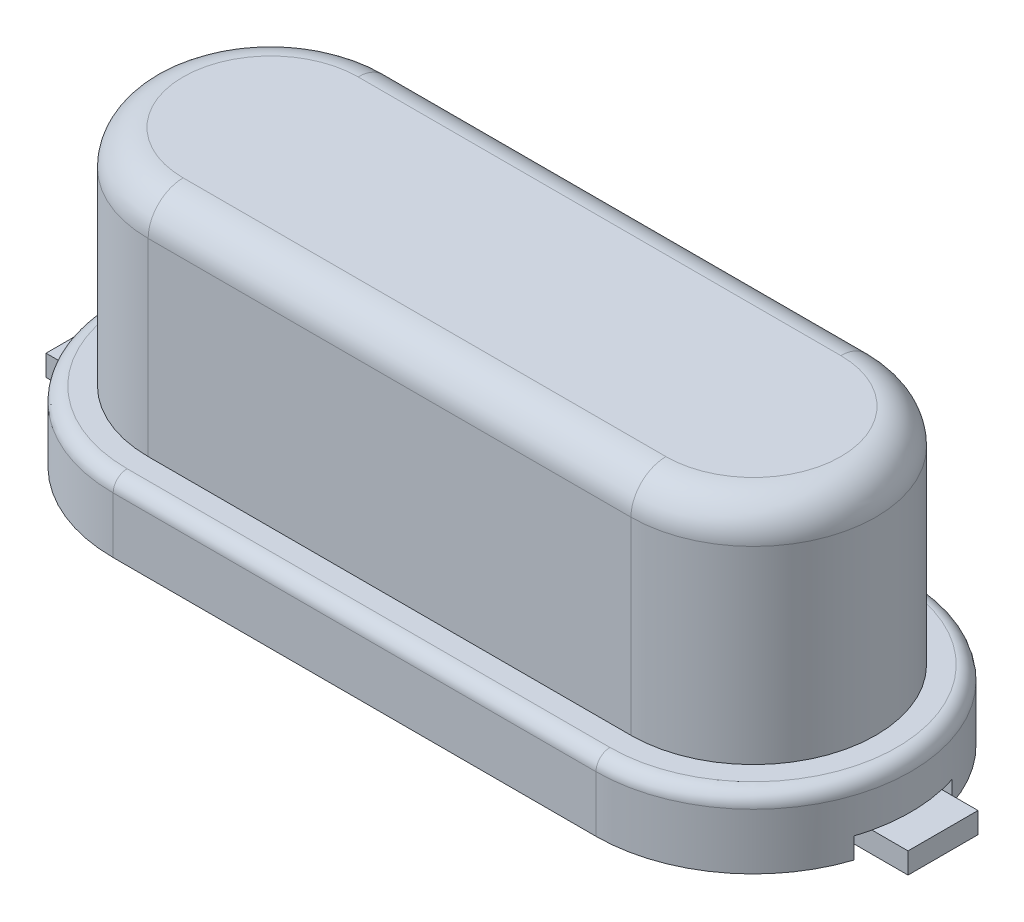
ISO-10303-21;
HEADER;
FILE_DESCRIPTION(('STEP AP214'),'2;1');
FILE_NAME('part.step','',(''),(''),'','','');
FILE_SCHEMA(('AUTOMOTIVE_DESIGN { 1 0 10303 214 1 1 1 1 }'));
ENDSEC;
DATA;
#1=APPLICATION_CONTEXT('core data for automotive mechanical design processes');
#2=APPLICATION_PROTOCOL_DEFINITION('international standard','automotive_design',2000,#1);
#3=PRODUCT_CONTEXT('',#1,'mechanical');
#4=PRODUCT('Part','Part','',(#3));
#5=PRODUCT_RELATED_PRODUCT_CATEGORY('part','',(#4));
#6=PRODUCT_DEFINITION_FORMATION('','',#4);
#7=PRODUCT_DEFINITION_CONTEXT('part definition',#1,'design');
#8=PRODUCT_DEFINITION('design','',#6,#7);
#9=PRODUCT_DEFINITION_SHAPE('','',#8);
#10=(LENGTH_UNIT() NAMED_UNIT(*) SI_UNIT(.MILLI.,.METRE.));
#11=(NAMED_UNIT(*) PLANE_ANGLE_UNIT() SI_UNIT($,.RADIAN.));
#12=(NAMED_UNIT(*) SI_UNIT($,.STERADIAN.) SOLID_ANGLE_UNIT());
#13=UNCERTAINTY_MEASURE_WITH_UNIT(LENGTH_MEASURE(1.E-05),#10,'distance_accuracy_value','');
#14=(GEOMETRIC_REPRESENTATION_CONTEXT(3) GLOBAL_UNCERTAINTY_ASSIGNED_CONTEXT((#13)) GLOBAL_UNIT_ASSIGNED_CONTEXT((#10,
#11,#12)) REPRESENTATION_CONTEXT('',''));
#15=CARTESIAN_POINT('',(0.,0.,0.));
#16=DIRECTION('',(0.,0.,1.));
#17=DIRECTION('',(1.,0.,0.));
#18=AXIS2_PLACEMENT_3D('',#15,#16,#17);
#19=CARTESIAN_POINT('',(3.45,1.,0.));
#20=DIRECTION('',(0.,1.,0.));
#21=DIRECTION('',(0.,0.,1.));
#22=AXIS2_PLACEMENT_3D('',#19,#20,#21);
#23=PLANE('',#22);
#24=DIRECTION('',(-1.,0.,0.));
#25=VECTOR('',#24,1.);
#26=CARTESIAN_POINT('',(-3.45,1.,-2.05));
#27=LINE('',#26,#25);
#28=CARTESIAN_POINT('',(3.45,1.,-2.05));
#29=VERTEX_POINT('',#28);
#30=CARTESIAN_POINT('',(-3.45,1.,-2.05));
#31=VERTEX_POINT('',#30);
#32=EDGE_CURVE('E487',#29,#31,#27,.T.);
#33=ORIENTED_EDGE('',*,*,#32,.T.);
#34=CARTESIAN_POINT('',(-3.45,1.,0.));
#35=DIRECTION('',(0.,1.,0.));
#36=DIRECTION('',(0.,0.,1.));
#37=AXIS2_PLACEMENT_3D('',#34,#35,#36);
#38=CIRCLE('',#37,2.05);
#39=CARTESIAN_POINT('',(-3.45,1.,2.05));
#40=VERTEX_POINT('',#39);
#41=EDGE_CURVE('E490',#31,#40,#38,.T.);
#42=ORIENTED_EDGE('',*,*,#41,.T.);
#43=DIRECTION('',(1.,0.,0.));
#44=VECTOR('',#43,1.);
#45=CARTESIAN_POINT('',(3.45,1.,2.05));
#46=LINE('',#45,#44);
#47=CARTESIAN_POINT('',(3.45,1.,2.05));
#48=VERTEX_POINT('',#47);
#49=EDGE_CURVE('E481',#40,#48,#46,.T.);
#50=ORIENTED_EDGE('',*,*,#49,.T.);
#51=CARTESIAN_POINT('',(3.45,1.,0.));
#52=DIRECTION('',(0.,1.,0.));
#53=DIRECTION('',(0.,0.,1.));
#54=AXIS2_PLACEMENT_3D('',#51,#52,#53);
#55=CIRCLE('',#54,2.05);
#56=EDGE_CURVE('E484',#48,#29,#55,.T.);
#57=ORIENTED_EDGE('',*,*,#56,.T.);
#58=EDGE_LOOP('',(#33,#42,#50,#57));
#59=FACE_BOUND('',#58,.T.);
#60=DIRECTION('',(-1.,0.,0.));
#61=VECTOR('',#60,1.);
#62=CARTESIAN_POINT('',(3.45,1.,-1.75));
#63=LINE('',#62,#61);
#64=CARTESIAN_POINT('',(3.45,1.,-1.75));
#65=VERTEX_POINT('',#64);
#66=CARTESIAN_POINT('',(-3.45,1.,-1.75));
#67=VERTEX_POINT('',#66);
#68=EDGE_CURVE('E257',#65,#67,#63,.T.);
#69=ORIENTED_EDGE('',*,*,#68,.F.);
#70=CARTESIAN_POINT('',(3.45,1.,0.));
#71=DIRECTION('',(0.,1.,0.));
#72=DIRECTION('',(0.,0.,1.));
#73=AXIS2_PLACEMENT_3D('',#70,#71,#72);
#74=CIRCLE('',#73,1.75);
#75=CARTESIAN_POINT('',(3.45,1.,1.75));
#76=VERTEX_POINT('',#75);
#77=EDGE_CURVE('E238',#76,#65,#74,.T.);
#78=ORIENTED_EDGE('',*,*,#77,.F.);
#79=DIRECTION('',(1.,0.,0.));
#80=VECTOR('',#79,1.);
#81=CARTESIAN_POINT('',(-3.45,1.,1.75));
#82=LINE('',#81,#80);
#83=CARTESIAN_POINT('',(-3.45,1.,1.75));
#84=VERTEX_POINT('',#83);
#85=EDGE_CURVE('E246',#84,#76,#82,.T.);
#86=ORIENTED_EDGE('',*,*,#85,.F.);
#87=CARTESIAN_POINT('',(-3.45,1.,0.));
#88=DIRECTION('',(0.,1.,0.));
#89=DIRECTION('',(0.,0.,1.));
#90=AXIS2_PLACEMENT_3D('',#87,#88,#89);
#91=CIRCLE('',#90,1.75);
#92=EDGE_CURVE('E270',#67,#84,#91,.T.);
#93=ORIENTED_EDGE('',*,*,#92,.F.);
#94=EDGE_LOOP('',(#69,#78,#86,#93));
#95=FACE_BOUND('',#94,.T.);
#96=ADVANCED_FACE('F37',(#59,#95),#23,.T.);
#97=CARTESIAN_POINT('',(3.45,0.3,0.));
#98=DIRECTION('',(0.,1.,0.));
#99=DIRECTION('',(0.,0.,1.));
#100=AXIS2_PLACEMENT_3D('',#97,#98,#99);
#101=PLANE('',#100);
#102=DIRECTION('',(1.,0.,0.));
#103=VECTOR('',#102,1.);
#104=CARTESIAN_POINT('',(-1.64,0.3,-0.699999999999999));
#105=LINE('',#104,#103);
#106=CARTESIAN_POINT('',(-5.58834047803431,0.3,-0.699999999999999));
#107=VERTEX_POINT('',#106);
#108=CARTESIAN_POINT('',(-1.64,0.3,-0.699999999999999));
#109=VERTEX_POINT('',#108);
#110=EDGE_CURVE('E277',#107,#109,#105,.T.);
#111=ORIENTED_EDGE('',*,*,#110,.T.);
#112=DIRECTION('',(0.,0.,1.));
#113=VECTOR('',#112,1.);
#114=CARTESIAN_POINT('',(-1.64,0.3,0.7));
#115=LINE('',#114,#113);
#116=CARTESIAN_POINT('',(-1.64,0.3,0.7));
#117=VERTEX_POINT('',#116);
#118=EDGE_CURVE('E282',#109,#117,#115,.T.);
#119=ORIENTED_EDGE('',*,*,#118,.T.);
#120=DIRECTION('',(-1.,0.,0.));
#121=VECTOR('',#120,1.);
#122=CARTESIAN_POINT('',(-5.58834047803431,0.3,0.7));
#123=LINE('',#122,#121);
#124=CARTESIAN_POINT('',(-5.58834047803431,0.3,0.700000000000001));
#125=VERTEX_POINT('',#124);
#126=EDGE_CURVE('E286',#117,#125,#123,.T.);
#127=ORIENTED_EDGE('',*,*,#126,.T.);
#128=CARTESIAN_POINT('',(-3.45,0.3,0.));
#129=DIRECTION('',(0.,1.,0.));
#130=DIRECTION('',(0.,0.,1.));
#131=AXIS2_PLACEMENT_3D('',#128,#129,#130);
#132=CIRCLE('',#131,2.25);
#133=CARTESIAN_POINT('',(-5.64374109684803,0.3,0.5));
#134=VERTEX_POINT('',#133);
#135=EDGE_CURVE('E418',#134,#125,#132,.T.);
#136=ORIENTED_EDGE('',*,*,#135,.F.);
#137=DIRECTION('',(1.,0.,0.));
#138=VECTOR('',#137,1.);
#139=CARTESIAN_POINT('',(-6.16,0.3,0.5));
#140=LINE('',#139,#138);
#141=CARTESIAN_POINT('',(-1.84,0.3,0.5));
#142=VERTEX_POINT('',#141);
#143=EDGE_CURVE('E440',#134,#142,#140,.T.);
#144=ORIENTED_EDGE('',*,*,#143,.T.);
#145=DIRECTION('',(0.,0.,-1.));
#146=VECTOR('',#145,1.);
#147=CARTESIAN_POINT('',(-1.84,0.3,0.5));
#148=LINE('',#147,#146);
#149=CARTESIAN_POINT('',(-1.84,0.3,-0.5));
#150=VERTEX_POINT('',#149);
#151=EDGE_CURVE('E445',#142,#150,#148,.T.);
#152=ORIENTED_EDGE('',*,*,#151,.T.);
#153=DIRECTION('',(-1.,0.,0.));
#154=VECTOR('',#153,1.);
#155=CARTESIAN_POINT('',(-6.16,0.3,-0.5));
#156=LINE('',#155,#154);
#157=CARTESIAN_POINT('',(-5.64374109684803,0.3,-0.5));
#158=VERTEX_POINT('',#157);
#159=EDGE_CURVE('E450',#150,#158,#156,.T.);
#160=ORIENTED_EDGE('',*,*,#159,.T.);
#161=EDGE_CURVE('E420',#107,#158,#132,.T.);
#162=ORIENTED_EDGE('',*,*,#161,.F.);
#163=EDGE_LOOP('',(#111,#119,#127,#136,#144,#152,#160,#162));
#164=FACE_BOUND('',#163,.T.);
#165=ADVANCED_FACE('F585',(#164),#101,.F.);
#166=DIRECTION('',(1.,0.,0.));
#167=VECTOR('',#166,1.);
#168=CARTESIAN_POINT('',(5.58834047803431,0.3,-0.700000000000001));
#169=LINE('',#168,#167);
#170=CARTESIAN_POINT('',(1.64,0.3,-0.7));
#171=VERTEX_POINT('',#170);
#172=CARTESIAN_POINT('',(5.58834047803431,0.3,-0.700000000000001));
#173=VERTEX_POINT('',#172);
#174=EDGE_CURVE('E273',#171,#173,#169,.T.);
#175=ORIENTED_EDGE('',*,*,#174,.T.);
#176=CARTESIAN_POINT('',(3.45,0.3,0.));
#177=DIRECTION('',(0.,1.,0.));
#178=DIRECTION('',(0.,0.,1.));
#179=AXIS2_PLACEMENT_3D('',#176,#177,#178);
#180=CIRCLE('',#179,2.25);
#181=CARTESIAN_POINT('',(5.64374109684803,0.3,-0.5));
#182=VERTEX_POINT('',#181);
#183=EDGE_CURVE('E414',#182,#173,#180,.T.);
#184=ORIENTED_EDGE('',*,*,#183,.F.);
#185=DIRECTION('',(-1.,0.,0.));
#186=VECTOR('',#185,1.);
#187=CARTESIAN_POINT('',(6.16,0.3,-0.5));
#188=LINE('',#187,#186);
#189=CARTESIAN_POINT('',(1.84,0.3,-0.5));
#190=VERTEX_POINT('',#189);
#191=EDGE_CURVE('E378',#182,#190,#188,.T.);
#192=ORIENTED_EDGE('',*,*,#191,.T.);
#193=DIRECTION('',(0.,0.,1.));
#194=VECTOR('',#193,1.);
#195=CARTESIAN_POINT('',(1.84,0.3,0.5));
#196=LINE('',#195,#194);
#197=CARTESIAN_POINT('',(1.84,0.3,0.5));
#198=VERTEX_POINT('',#197);
#199=EDGE_CURVE('E382',#190,#198,#196,.T.);
#200=ORIENTED_EDGE('',*,*,#199,.T.);
#201=DIRECTION('',(1.,0.,0.));
#202=VECTOR('',#201,1.);
#203=CARTESIAN_POINT('',(6.16,0.3,0.5));
#204=LINE('',#203,#202);
#205=CARTESIAN_POINT('',(5.64374109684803,0.3,0.5));
#206=VERTEX_POINT('',#205);
#207=EDGE_CURVE('E370',#198,#206,#204,.T.);
#208=ORIENTED_EDGE('',*,*,#207,.T.);
#209=CARTESIAN_POINT('',(5.58834047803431,0.3,0.7));
#210=VERTEX_POINT('',#209);
#211=EDGE_CURVE('E415',#210,#206,#180,.T.);
#212=ORIENTED_EDGE('',*,*,#211,.F.);
#213=DIRECTION('',(-1.,0.,0.));
#214=VECTOR('',#213,1.);
#215=CARTESIAN_POINT('',(1.64,0.3,0.7));
#216=LINE('',#215,#214);
#217=CARTESIAN_POINT('',(1.64,0.3,0.7));
#218=VERTEX_POINT('',#217);
#219=EDGE_CURVE('E290',#210,#218,#216,.T.);
#220=ORIENTED_EDGE('',*,*,#219,.T.);
#221=DIRECTION('',(0.,0.,-1.));
#222=VECTOR('',#221,1.);
#223=CARTESIAN_POINT('',(1.64,0.3,-0.7));
#224=LINE('',#223,#222);
#225=EDGE_CURVE('E294',#218,#171,#224,.T.);
#226=ORIENTED_EDGE('',*,*,#225,.T.);
#227=EDGE_LOOP('',(#175,#184,#192,#200,#208,#212,#220,#226));
#228=FACE_BOUND('',#227,.T.);
#229=ADVANCED_FACE('F591',(#228),#101,.F.);
#230=CARTESIAN_POINT('',(-6.16,0.3,-0.5));
#231=DIRECTION('',(0.,-1.,0.));
#232=DIRECTION('',(0.,0.,-1.));
#233=AXIS2_PLACEMENT_3D('',#230,#231,#232);
#234=PLANE('',#233);
#235=EDGE_CURVE('E424',#158,#134,#132,.T.);
#236=ORIENTED_EDGE('',*,*,#235,.F.);
#237=CARTESIAN_POINT('',(-6.16,0.3,-0.5));
#238=VERTEX_POINT('',#237);
#239=EDGE_CURVE('E449',#158,#238,#156,.T.);
#240=ORIENTED_EDGE('',*,*,#239,.T.);
#241=DIRECTION('',(0.,0.,1.));
#242=VECTOR('',#241,1.);
#243=CARTESIAN_POINT('',(-6.16,0.3,0.5));
#244=LINE('',#243,#242);
#245=CARTESIAN_POINT('',(-6.16,0.3,0.5));
#246=VERTEX_POINT('',#245);
#247=EDGE_CURVE('E437',#238,#246,#244,.T.);
#248=ORIENTED_EDGE('',*,*,#247,.T.);
#249=EDGE_CURVE('E442',#246,#134,#140,.T.);
#250=ORIENTED_EDGE('',*,*,#249,.T.);
#251=EDGE_LOOP('',(#236,#240,#248,#250));
#252=FACE_BOUND('',#251,.T.);
#253=ADVANCED_FACE('F616',(#252),#234,.F.);
#254=CARTESIAN_POINT('',(-6.16,0.3,0.5));
#255=DIRECTION('',(1.,0.,0.));
#256=DIRECTION('',(0.,0.,-1.));
#257=AXIS2_PLACEMENT_3D('',#254,#255,#256);
#258=PLANE('',#257);
#259=DIRECTION('',(0.,0.,1.));
#260=VECTOR('',#259,1.);
#261=CARTESIAN_POINT('',(-6.16,0.,0.5));
#262=LINE('',#261,#260);
#263=CARTESIAN_POINT('',(-6.16,0.,-0.5));
#264=VERTEX_POINT('',#263);
#265=CARTESIAN_POINT('',(-6.16,0.,0.5));
#266=VERTEX_POINT('',#265);
#267=EDGE_CURVE('E436',#264,#266,#262,.T.);
#268=ORIENTED_EDGE('',*,*,#267,.T.);
#269=DIRECTION('',(0.,-1.,0.));
#270=VECTOR('',#269,1.);
#271=CARTESIAN_POINT('',(-6.16,0.3,0.5));
#272=LINE('',#271,#270);
#273=EDGE_CURVE('E477',#246,#266,#272,.T.);
#274=ORIENTED_EDGE('',*,*,#273,.F.);
#275=ORIENTED_EDGE('',*,*,#247,.F.);
#276=DIRECTION('',(0.,-1.,0.));
#277=VECTOR('',#276,1.);
#278=CARTESIAN_POINT('',(-6.16,0.3,-0.5));
#279=LINE('',#278,#277);
#280=EDGE_CURVE('E454',#238,#264,#279,.T.);
#281=ORIENTED_EDGE('',*,*,#280,.T.);
#282=EDGE_LOOP('',(#268,#274,#275,#281));
#283=FACE_BOUND('',#282,.T.);
#284=ADVANCED_FACE('F619',(#283),#258,.F.);
#285=CARTESIAN_POINT('',(-6.16,0.3,0.5));
#286=DIRECTION('',(0.,0.,-1.));
#287=DIRECTION('',(-1.,0.,0.));
#288=AXIS2_PLACEMENT_3D('',#285,#286,#287);
#289=PLANE('',#288);
#290=DIRECTION('',(1.,0.,0.));
#291=VECTOR('',#290,1.);
#292=CARTESIAN_POINT('',(-6.16,0.,0.5));
#293=LINE('',#292,#291);
#294=CARTESIAN_POINT('',(-1.84,0.,0.5));
#295=VERTEX_POINT('',#294);
#296=EDGE_CURVE('E458',#266,#295,#293,.T.);
#297=ORIENTED_EDGE('',*,*,#296,.T.);
#298=DIRECTION('',(0.,-1.,0.));
#299=VECTOR('',#298,1.);
#300=CARTESIAN_POINT('',(-1.84,0.3,0.5));
#301=LINE('',#300,#299);
#302=EDGE_CURVE('E473',#142,#295,#301,.T.);
#303=ORIENTED_EDGE('',*,*,#302,.F.);
#304=ORIENTED_EDGE('',*,*,#143,.F.);
#305=ORIENTED_EDGE('',*,*,#249,.F.);
#306=ORIENTED_EDGE('',*,*,#273,.T.);
#307=EDGE_LOOP('',(#297,#303,#304,#305,#306));
#308=FACE_BOUND('',#307,.T.);
#309=ADVANCED_FACE('F631',(#308),#289,.F.);
#310=CARTESIAN_POINT('',(-1.84,0.3,0.5));
#311=DIRECTION('',(-1.,0.,0.));
#312=DIRECTION('',(0.,0.,1.));
#313=AXIS2_PLACEMENT_3D('',#310,#311,#312);
#314=PLANE('',#313);
#315=DIRECTION('',(0.,0.,-1.));
#316=VECTOR('',#315,1.);
#317=CARTESIAN_POINT('',(-1.84,0.,0.5));
#318=LINE('',#317,#316);
#319=CARTESIAN_POINT('',(-1.84,0.,-0.5));
#320=VERTEX_POINT('',#319);
#321=EDGE_CURVE('E461',#295,#320,#318,.T.);
#322=ORIENTED_EDGE('',*,*,#321,.T.);
#323=DIRECTION('',(0.,-1.,0.));
#324=VECTOR('',#323,1.);
#325=CARTESIAN_POINT('',(-1.84,0.3,-0.5));
#326=LINE('',#325,#324);
#327=EDGE_CURVE('E469',#150,#320,#326,.T.);
#328=ORIENTED_EDGE('',*,*,#327,.F.);
#329=ORIENTED_EDGE('',*,*,#151,.F.);
#330=ORIENTED_EDGE('',*,*,#302,.T.);
#331=EDGE_LOOP('',(#322,#328,#329,#330));
#332=FACE_BOUND('',#331,.T.);
#333=ADVANCED_FACE('F627',(#332),#314,.F.);
#334=CARTESIAN_POINT('',(-6.16,0.3,-0.5));
#335=DIRECTION('',(0.,0.,1.));
#336=DIRECTION('',(1.,0.,0.));
#337=AXIS2_PLACEMENT_3D('',#334,#335,#336);
#338=PLANE('',#337);
#339=DIRECTION('',(-1.,0.,0.));
#340=VECTOR('',#339,1.);
#341=CARTESIAN_POINT('',(-6.16,0.,-0.5));
#342=LINE('',#341,#340);
#343=EDGE_CURVE('E441',#320,#264,#342,.T.);
#344=ORIENTED_EDGE('',*,*,#343,.T.);
#345=ORIENTED_EDGE('',*,*,#280,.F.);
#346=ORIENTED_EDGE('',*,*,#239,.F.);
#347=ORIENTED_EDGE('',*,*,#159,.F.);
#348=ORIENTED_EDGE('',*,*,#327,.T.);
#349=EDGE_LOOP('',(#344,#345,#346,#347,#348));
#350=FACE_BOUND('',#349,.T.);
#351=ADVANCED_FACE('F623',(#350),#338,.F.);
#352=CARTESIAN_POINT('',(-6.16,0.,-0.5));
#353=DIRECTION('',(0.,-1.,0.));
#354=DIRECTION('',(0.,0.,-1.));
#355=AXIS2_PLACEMENT_3D('',#352,#353,#354);
#356=PLANE('',#355);
#357=ORIENTED_EDGE('',*,*,#267,.F.);
#358=ORIENTED_EDGE('',*,*,#343,.F.);
#359=ORIENTED_EDGE('',*,*,#321,.F.);
#360=ORIENTED_EDGE('',*,*,#296,.F.);
#361=EDGE_LOOP('',(#357,#358,#359,#360));
#362=FACE_BOUND('',#361,.T.);
#363=ADVANCED_FACE('F614',(#362),#356,.T.);
#364=CARTESIAN_POINT('',(3.45,1.,0.));
#365=DIRECTION('',(0.,-1.,0.));
#366=DIRECTION('',(0.,0.,-1.));
#367=AXIS2_PLACEMENT_3D('',#364,#365,#366);
#368=CYLINDRICAL_SURFACE('',#367,2.25);
#369=DIRECTION('',(0.,-1.,0.));
#370=VECTOR('',#369,1.);
#371=CARTESIAN_POINT('',(3.45,1.,-2.25));
#372=LINE('',#371,#370);
#373=CARTESIAN_POINT('',(3.45,0.8,-2.25));
#374=VERTEX_POINT('',#373);
#375=CARTESIAN_POINT('',(3.45,0.,-2.25));
#376=VERTEX_POINT('',#375);
#377=EDGE_CURVE('E433',#374,#376,#372,.T.);
#378=ORIENTED_EDGE('',*,*,#377,.F.);
#379=CARTESIAN_POINT('',(3.45,0.8,0.));
#380=DIRECTION('',(0.,1.,0.));
#381=DIRECTION('',(0.,0.,1.));
#382=AXIS2_PLACEMENT_3D('',#379,#380,#381);
#383=CIRCLE('',#382,2.25);
#384=CARTESIAN_POINT('',(3.45,0.8,2.25));
#385=VERTEX_POINT('',#384);
#386=EDGE_CURVE('E501',#374,#385,#383,.F.);
#387=ORIENTED_EDGE('',*,*,#386,.T.);
#388=DIRECTION('',(0.,-1.,0.));
#389=VECTOR('',#388,1.);
#390=CARTESIAN_POINT('',(3.45,1.,2.25));
#391=LINE('',#390,#389);
#392=CARTESIAN_POINT('',(3.45,0.,2.25));
#393=VERTEX_POINT('',#392);
#394=EDGE_CURVE('E423',#385,#393,#391,.T.);
#395=ORIENTED_EDGE('',*,*,#394,.T.);
#396=CARTESIAN_POINT('',(3.45,0.,0.));
#397=DIRECTION('',(0.,1.,0.));
#398=DIRECTION('',(0.,0.,1.));
#399=AXIS2_PLACEMENT_3D('',#396,#397,#398);
#400=CIRCLE('',#399,2.25);
#401=CARTESIAN_POINT('',(5.58834047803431,0.,0.7));
#402=VERTEX_POINT('',#401);
#403=EDGE_CURVE('E330',#393,#402,#400,.T.);
#404=ORIENTED_EDGE('',*,*,#403,.T.);
#405=DIRECTION('',(0.,-1.,0.));
#406=VECTOR('',#405,1.);
#407=CARTESIAN_POINT('',(5.58834047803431,0.3,0.7));
#408=LINE('',#407,#406);
#409=EDGE_CURVE('E345',#210,#402,#408,.T.);
#410=ORIENTED_EDGE('',*,*,#409,.F.);
#411=ORIENTED_EDGE('',*,*,#211,.T.);
#412=EDGE_CURVE('E419',#206,#182,#180,.T.);
#413=ORIENTED_EDGE('',*,*,#412,.T.);
#414=ORIENTED_EDGE('',*,*,#183,.T.);
#415=DIRECTION('',(0.,-1.,0.));
#416=VECTOR('',#415,1.);
#417=CARTESIAN_POINT('',(5.58834047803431,0.3,-0.700000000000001));
#418=LINE('',#417,#416);
#419=CARTESIAN_POINT('',(5.58834047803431,0.,-0.700000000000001));
#420=VERTEX_POINT('',#419);
#421=EDGE_CURVE('E365',#173,#420,#418,.T.);
#422=ORIENTED_EDGE('',*,*,#421,.T.);
#423=CARTESIAN_POINT('',(3.45,0.,0.));
#424=DIRECTION('',(0.,1.,0.));
#425=DIRECTION('',(0.,0.,1.));
#426=AXIS2_PLACEMENT_3D('',#423,#424,#425);
#427=CIRCLE('',#426,2.25);
#428=EDGE_CURVE('E302',#420,#376,#427,.T.);
#429=ORIENTED_EDGE('',*,*,#428,.T.);
#430=EDGE_LOOP('',(#378,#387,#395,#404,#410,#411,#413,#414,#422,#429));
#431=FACE_BOUND('',#430,.T.);
#432=ADVANCED_FACE('F610',(#431),#368,.T.);
#433=CARTESIAN_POINT('',(3.45,1.,-2.25));
#434=DIRECTION('',(0.,0.,1.));
#435=DIRECTION('',(1.,0.,0.));
#436=AXIS2_PLACEMENT_3D('',#433,#434,#435);
#437=PLANE('',#436);
#438=DIRECTION('',(0.,-1.,0.));
#439=VECTOR('',#438,1.);
#440=CARTESIAN_POINT('',(-3.45,1.,-2.25));
#441=LINE('',#440,#439);
#442=CARTESIAN_POINT('',(-3.45,0.8,-2.25));
#443=VERTEX_POINT('',#442);
#444=CARTESIAN_POINT('',(-3.45,0.,-2.25));
#445=VERTEX_POINT('',#444);
#446=EDGE_CURVE('E430',#443,#445,#441,.T.);
#447=ORIENTED_EDGE('',*,*,#446,.F.);
#448=DIRECTION('',(-1.,0.,0.));
#449=VECTOR('',#448,1.);
#450=CARTESIAN_POINT('',(3.45,0.8,-2.25));
#451=LINE('',#450,#449);
#452=EDGE_CURVE('E498',#443,#374,#451,.F.);
#453=ORIENTED_EDGE('',*,*,#452,.T.);
#454=ORIENTED_EDGE('',*,*,#377,.T.);
#455=DIRECTION('',(-1.,0.,0.));
#456=VECTOR('',#455,1.);
#457=CARTESIAN_POINT('',(-3.45,0.,-2.25));
#458=LINE('',#457,#456);
#459=EDGE_CURVE('E306',#376,#445,#458,.T.);
#460=ORIENTED_EDGE('',*,*,#459,.T.);
#461=EDGE_LOOP('',(#447,#453,#454,#460));
#462=FACE_BOUND('',#461,.T.);
#463=ADVANCED_FACE('F606',(#462),#437,.F.);
#464=CARTESIAN_POINT('',(-3.45,1.,0.));
#465=DIRECTION('',(0.,-1.,0.));
#466=DIRECTION('',(0.,0.,-1.));
#467=AXIS2_PLACEMENT_3D('',#464,#465,#466);
#468=CYLINDRICAL_SURFACE('',#467,2.25);
#469=DIRECTION('',(0.,-1.,0.));
#470=VECTOR('',#469,1.);
#471=CARTESIAN_POINT('',(-3.45,1.,2.25));
#472=LINE('',#471,#470);
#473=CARTESIAN_POINT('',(-3.45,0.8,2.25));
#474=VERTEX_POINT('',#473);
#475=CARTESIAN_POINT('',(-3.45,0.,2.25));
#476=VERTEX_POINT('',#475);
#477=EDGE_CURVE('E427',#474,#476,#472,.T.);
#478=ORIENTED_EDGE('',*,*,#477,.F.);
#479=CARTESIAN_POINT('',(-3.45,0.8,0.));
#480=DIRECTION('',(0.,1.,0.));
#481=DIRECTION('',(0.,0.,1.));
#482=AXIS2_PLACEMENT_3D('',#479,#480,#481);
#483=CIRCLE('',#482,2.25);
#484=EDGE_CURVE('E494',#474,#443,#483,.F.);
#485=ORIENTED_EDGE('',*,*,#484,.T.);
#486=ORIENTED_EDGE('',*,*,#446,.T.);
#487=CARTESIAN_POINT('',(-3.45,0.,0.));
#488=DIRECTION('',(0.,1.,0.));
#489=DIRECTION('',(0.,0.,-1.));
#490=AXIS2_PLACEMENT_3D('',#487,#488,#489);
#491=CIRCLE('',#490,2.25);
#492=CARTESIAN_POINT('',(-5.58834047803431,0.,-0.699999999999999));
#493=VERTEX_POINT('',#492);
#494=EDGE_CURVE('E310',#445,#493,#491,.T.);
#495=ORIENTED_EDGE('',*,*,#494,.T.);
#496=DIRECTION('',(0.,-1.,0.));
#497=VECTOR('',#496,1.);
#498=CARTESIAN_POINT('',(-5.58834047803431,0.3,-0.699999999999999));
#499=LINE('',#498,#497);
#500=EDGE_CURVE('E361',#107,#493,#499,.T.);
#501=ORIENTED_EDGE('',*,*,#500,.F.);
#502=ORIENTED_EDGE('',*,*,#161,.T.);
#503=ORIENTED_EDGE('',*,*,#235,.T.);
#504=ORIENTED_EDGE('',*,*,#135,.T.);
#505=DIRECTION('',(0.,-1.,0.));
#506=VECTOR('',#505,1.);
#507=CARTESIAN_POINT('',(-5.58834047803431,0.3,0.700000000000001));
#508=LINE('',#507,#506);
#509=CARTESIAN_POINT('',(-5.58834047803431,0.,0.700000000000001));
#510=VERTEX_POINT('',#509);
#511=EDGE_CURVE('E349',#125,#510,#508,.T.);
#512=ORIENTED_EDGE('',*,*,#511,.T.);
#513=CARTESIAN_POINT('',(-3.45,0.,0.));
#514=DIRECTION('',(0.,1.,0.));
#515=DIRECTION('',(0.,0.,-1.));
#516=AXIS2_PLACEMENT_3D('',#513,#514,#515);
#517=CIRCLE('',#516,2.25);
#518=EDGE_CURVE('E322',#510,#476,#517,.T.);
#519=ORIENTED_EDGE('',*,*,#518,.T.);
#520=EDGE_LOOP('',(#478,#485,#486,#495,#501,#502,#503,#504,#512,#519));
#521=FACE_BOUND('',#520,.T.);
#522=ADVANCED_FACE('F602',(#521),#468,.T.);
#523=CARTESIAN_POINT('',(-3.45,1.,2.25));
#524=DIRECTION('',(0.,0.,-1.));
#525=DIRECTION('',(-1.,0.,0.));
#526=AXIS2_PLACEMENT_3D('',#523,#524,#525);
#527=PLANE('',#526);
#528=ORIENTED_EDGE('',*,*,#394,.F.);
#529=DIRECTION('',(1.,0.,0.));
#530=VECTOR('',#529,1.);
#531=CARTESIAN_POINT('',(-3.45,0.8,2.25));
#532=LINE('',#531,#530);
#533=EDGE_CURVE('E504',#385,#474,#532,.F.);
#534=ORIENTED_EDGE('',*,*,#533,.T.);
#535=ORIENTED_EDGE('',*,*,#477,.T.);
#536=DIRECTION('',(1.,0.,0.));
#537=VECTOR('',#536,1.);
#538=CARTESIAN_POINT('',(-3.45,0.,2.25));
#539=LINE('',#538,#537);
#540=EDGE_CURVE('E326',#476,#393,#539,.T.);
#541=ORIENTED_EDGE('',*,*,#540,.T.);
#542=EDGE_LOOP('',(#528,#534,#535,#541));
#543=FACE_BOUND('',#542,.T.);
#544=ADVANCED_FACE('F598',(#543),#527,.F.);
#545=CARTESIAN_POINT('',(1.84,0.3,0.5));
#546=DIRECTION('',(0.,-1.,0.));
#547=DIRECTION('',(0.,0.,-1.));
#548=AXIS2_PLACEMENT_3D('',#545,#546,#547);
#549=PLANE('',#548);
#550=CARTESIAN_POINT('',(6.16,0.3,-0.5));
#551=VERTEX_POINT('',#550);
#552=EDGE_CURVE('E379',#551,#182,#188,.T.);
#553=ORIENTED_EDGE('',*,*,#552,.T.);
#554=ORIENTED_EDGE('',*,*,#412,.F.);
#555=CARTESIAN_POINT('',(6.16,0.3,0.5));
#556=VERTEX_POINT('',#555);
#557=EDGE_CURVE('E375',#206,#556,#204,.T.);
#558=ORIENTED_EDGE('',*,*,#557,.T.);
#559=DIRECTION('',(0.,0.,-1.));
#560=VECTOR('',#559,1.);
#561=CARTESIAN_POINT('',(6.16,0.3,0.5));
#562=LINE('',#561,#560);
#563=EDGE_CURVE('E374',#556,#551,#562,.T.);
#564=ORIENTED_EDGE('',*,*,#563,.T.);
#565=EDGE_LOOP('',(#553,#554,#558,#564));
#566=FACE_BOUND('',#565,.T.);
#567=ADVANCED_FACE('F601',(#566),#549,.F.);
#568=CARTESIAN_POINT('',(6.16,0.3,0.5));
#569=DIRECTION('',(0.,0.,-1.));
#570=DIRECTION('',(-1.,0.,0.));
#571=AXIS2_PLACEMENT_3D('',#568,#569,#570);
#572=PLANE('',#571);
#573=DIRECTION('',(1.,0.,0.));
#574=VECTOR('',#573,1.);
#575=CARTESIAN_POINT('',(6.16,0.,0.5));
#576=LINE('',#575,#574);
#577=CARTESIAN_POINT('',(1.84,0.,0.5));
#578=VERTEX_POINT('',#577);
#579=CARTESIAN_POINT('',(6.16,0.,0.5));
#580=VERTEX_POINT('',#579);
#581=EDGE_CURVE('E369',#578,#580,#576,.T.);
#582=ORIENTED_EDGE('',*,*,#581,.T.);
#583=DIRECTION('',(0.,-1.,0.));
#584=VECTOR('',#583,1.);
#585=CARTESIAN_POINT('',(6.16,0.3,0.5));
#586=LINE('',#585,#584);
#587=EDGE_CURVE('E410',#556,#580,#586,.T.);
#588=ORIENTED_EDGE('',*,*,#587,.F.);
#589=ORIENTED_EDGE('',*,*,#557,.F.);
#590=ORIENTED_EDGE('',*,*,#207,.F.);
#591=DIRECTION('',(0.,-1.,0.));
#592=VECTOR('',#591,1.);
#593=CARTESIAN_POINT('',(1.84,0.3,0.5));
#594=LINE('',#593,#592);
#595=EDGE_CURVE('E386',#198,#578,#594,.T.);
#596=ORIENTED_EDGE('',*,*,#595,.T.);
#597=EDGE_LOOP('',(#582,#588,#589,#590,#596));
#598=FACE_BOUND('',#597,.T.);
#599=ADVANCED_FACE('F595',(#598),#572,.F.);
#600=CARTESIAN_POINT('',(6.16,0.3,0.5));
#601=DIRECTION('',(-1.,0.,0.));
#602=DIRECTION('',(0.,0.,1.));
#603=AXIS2_PLACEMENT_3D('',#600,#601,#602);
#604=PLANE('',#603);
#605=DIRECTION('',(0.,0.,-1.));
#606=VECTOR('',#605,1.);
#607=CARTESIAN_POINT('',(6.16,0.,0.5));
#608=LINE('',#607,#606);
#609=CARTESIAN_POINT('',(6.16,0.,-0.5));
#610=VERTEX_POINT('',#609);
#611=EDGE_CURVE('E390',#580,#610,#608,.T.);
#612=ORIENTED_EDGE('',*,*,#611,.T.);
#613=DIRECTION('',(0.,-1.,0.));
#614=VECTOR('',#613,1.);
#615=CARTESIAN_POINT('',(6.16,0.3,-0.5));
#616=LINE('',#615,#614);
#617=EDGE_CURVE('E406',#551,#610,#616,.T.);
#618=ORIENTED_EDGE('',*,*,#617,.F.);
#619=ORIENTED_EDGE('',*,*,#563,.F.);
#620=ORIENTED_EDGE('',*,*,#587,.T.);
#621=EDGE_LOOP('',(#612,#618,#619,#620));
#622=FACE_BOUND('',#621,.T.);
#623=ADVANCED_FACE('F790',(#622),#604,.F.);
#624=CARTESIAN_POINT('',(6.16,0.3,-0.5));
#625=DIRECTION('',(0.,0.,1.));
#626=DIRECTION('',(1.,0.,0.));
#627=AXIS2_PLACEMENT_3D('',#624,#625,#626);
#628=PLANE('',#627);
#629=DIRECTION('',(-1.,0.,0.));
#630=VECTOR('',#629,1.);
#631=CARTESIAN_POINT('',(6.16,0.,-0.5));
#632=LINE('',#631,#630);
#633=CARTESIAN_POINT('',(1.84,0.,-0.5));
#634=VERTEX_POINT('',#633);
#635=EDGE_CURVE('E393',#610,#634,#632,.T.);
#636=ORIENTED_EDGE('',*,*,#635,.T.);
#637=DIRECTION('',(0.,-1.,0.));
#638=VECTOR('',#637,1.);
#639=CARTESIAN_POINT('',(1.84,0.3,-0.5));
#640=LINE('',#639,#638);
#641=EDGE_CURVE('E402',#190,#634,#640,.T.);
#642=ORIENTED_EDGE('',*,*,#641,.F.);
#643=ORIENTED_EDGE('',*,*,#191,.F.);
#644=ORIENTED_EDGE('',*,*,#552,.F.);
#645=ORIENTED_EDGE('',*,*,#617,.T.);
#646=EDGE_LOOP('',(#636,#642,#643,#644,#645));
#647=FACE_BOUND('',#646,.T.);
#648=ADVANCED_FACE('F781',(#647),#628,.F.);
#649=CARTESIAN_POINT('',(1.84,0.3,0.5));
#650=DIRECTION('',(1.,0.,0.));
#651=DIRECTION('',(0.,0.,-1.));
#652=AXIS2_PLACEMENT_3D('',#649,#650,#651);
#653=PLANE('',#652);
#654=DIRECTION('',(0.,0.,1.));
#655=VECTOR('',#654,1.);
#656=CARTESIAN_POINT('',(1.84,0.,0.5));
#657=LINE('',#656,#655);
#658=EDGE_CURVE('E396',#634,#578,#657,.T.);
#659=ORIENTED_EDGE('',*,*,#658,.T.);
#660=ORIENTED_EDGE('',*,*,#595,.F.);
#661=ORIENTED_EDGE('',*,*,#199,.F.);
#662=ORIENTED_EDGE('',*,*,#641,.T.);
#663=EDGE_LOOP('',(#659,#660,#661,#662));
#664=FACE_BOUND('',#663,.T.);
#665=ADVANCED_FACE('F772',(#664),#653,.F.);
#666=CARTESIAN_POINT('',(1.84,0.,0.5));
#667=DIRECTION('',(0.,-1.,0.));
#668=DIRECTION('',(0.,0.,-1.));
#669=AXIS2_PLACEMENT_3D('',#666,#667,#668);
#670=PLANE('',#669);
#671=ORIENTED_EDGE('',*,*,#581,.F.);
#672=ORIENTED_EDGE('',*,*,#658,.F.);
#673=ORIENTED_EDGE('',*,*,#635,.F.);
#674=ORIENTED_EDGE('',*,*,#611,.F.);
#675=EDGE_LOOP('',(#671,#672,#673,#674));
#676=FACE_BOUND('',#675,.T.);
#677=ADVANCED_FACE('F763',(#676),#670,.T.);
#678=CARTESIAN_POINT('',(5.58834047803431,0.3,-0.700000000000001));
#679=DIRECTION('',(0.,0.,-1.));
#680=DIRECTION('',(-1.,0.,0.));
#681=AXIS2_PLACEMENT_3D('',#678,#679,#680);
#682=PLANE('',#681);
#683=DIRECTION('',(1.,0.,0.));
#684=VECTOR('',#683,1.);
#685=CARTESIAN_POINT('',(5.58834047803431,0.,-0.700000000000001));
#686=LINE('',#685,#684);
#687=CARTESIAN_POINT('',(1.64,0.,-0.7));
#688=VERTEX_POINT('',#687);
#689=EDGE_CURVE('E254',#688,#420,#686,.T.);
#690=ORIENTED_EDGE('',*,*,#689,.T.);
#691=ORIENTED_EDGE('',*,*,#421,.F.);
#692=ORIENTED_EDGE('',*,*,#174,.F.);
#693=DIRECTION('',(0.,-1.,0.));
#694=VECTOR('',#693,1.);
#695=CARTESIAN_POINT('',(1.64,0.3,-0.7));
#696=LINE('',#695,#694);
#697=EDGE_CURVE('E298',#171,#688,#696,.T.);
#698=ORIENTED_EDGE('',*,*,#697,.T.);
#699=EDGE_LOOP('',(#690,#691,#692,#698));
#700=FACE_BOUND('',#699,.T.);
#701=ADVANCED_FACE('F754',(#700),#682,.F.);
#702=CARTESIAN_POINT('',(-1.64,0.3,-0.699999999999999));
#703=DIRECTION('',(0.,0.,-1.));
#704=DIRECTION('',(-1.,0.,0.));
#705=AXIS2_PLACEMENT_3D('',#702,#703,#704);
#706=PLANE('',#705);
#707=DIRECTION('',(1.,0.,0.));
#708=VECTOR('',#707,1.);
#709=CARTESIAN_POINT('',(-1.64,0.,-0.699999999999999));
#710=LINE('',#709,#708);
#711=CARTESIAN_POINT('',(-1.64,0.,-0.699999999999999));
#712=VERTEX_POINT('',#711);
#713=EDGE_CURVE('E313',#493,#712,#710,.T.);
#714=ORIENTED_EDGE('',*,*,#713,.T.);
#715=DIRECTION('',(0.,-1.,0.));
#716=VECTOR('',#715,1.);
#717=CARTESIAN_POINT('',(-1.64,0.3,-0.699999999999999));
#718=LINE('',#717,#716);
#719=EDGE_CURVE('E357',#109,#712,#718,.T.);
#720=ORIENTED_EDGE('',*,*,#719,.F.);
#721=ORIENTED_EDGE('',*,*,#110,.F.);
#722=ORIENTED_EDGE('',*,*,#500,.T.);
#723=EDGE_LOOP('',(#714,#720,#721,#722));
#724=FACE_BOUND('',#723,.T.);
#725=ADVANCED_FACE('F745',(#724),#706,.F.);
#726=CARTESIAN_POINT('',(-1.64,0.3,0.7));
#727=DIRECTION('',(1.,0.,0.));
#728=DIRECTION('',(0.,0.,-1.));
#729=AXIS2_PLACEMENT_3D('',#726,#727,#728);
#730=PLANE('',#729);
#731=DIRECTION('',(0.,0.,1.));
#732=VECTOR('',#731,1.);
#733=CARTESIAN_POINT('',(-1.64,0.,0.7));
#734=LINE('',#733,#732);
#735=CARTESIAN_POINT('',(-1.64,0.,0.7));
#736=VERTEX_POINT('',#735);
#737=EDGE_CURVE('E316',#712,#736,#734,.T.);
#738=ORIENTED_EDGE('',*,*,#737,.T.);
#739=DIRECTION('',(0.,-1.,0.));
#740=VECTOR('',#739,1.);
#741=CARTESIAN_POINT('',(-1.64,0.3,0.7));
#742=LINE('',#741,#740);
#743=EDGE_CURVE('E353',#117,#736,#742,.T.);
#744=ORIENTED_EDGE('',*,*,#743,.F.);
#745=ORIENTED_EDGE('',*,*,#118,.F.);
#746=ORIENTED_EDGE('',*,*,#719,.T.);
#747=EDGE_LOOP('',(#738,#744,#745,#746));
#748=FACE_BOUND('',#747,.T.);
#749=ADVANCED_FACE('F736',(#748),#730,.F.);
#750=CARTESIAN_POINT('',(-5.58834047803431,0.3,0.7));
#751=DIRECTION('',(0.,0.,1.));
#752=DIRECTION('',(1.,0.,0.));
#753=AXIS2_PLACEMENT_3D('',#750,#751,#752);
#754=PLANE('',#753);
#755=DIRECTION('',(-1.,0.,0.));
#756=VECTOR('',#755,1.);
#757=CARTESIAN_POINT('',(-5.58834047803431,0.,0.7));
#758=LINE('',#757,#756);
#759=EDGE_CURVE('E319',#736,#510,#758,.T.);
#760=ORIENTED_EDGE('',*,*,#759,.T.);
#761=ORIENTED_EDGE('',*,*,#511,.F.);
#762=ORIENTED_EDGE('',*,*,#126,.F.);
#763=ORIENTED_EDGE('',*,*,#743,.T.);
#764=EDGE_LOOP('',(#760,#761,#762,#763));
#765=FACE_BOUND('',#764,.T.);
#766=ADVANCED_FACE('F727',(#765),#754,.F.);
#767=CARTESIAN_POINT('',(1.64,0.3,0.7));
#768=DIRECTION('',(0.,0.,1.));
#769=DIRECTION('',(1.,0.,0.));
#770=AXIS2_PLACEMENT_3D('',#767,#768,#769);
#771=PLANE('',#770);
#772=DIRECTION('',(-1.,0.,0.));
#773=VECTOR('',#772,1.);
#774=CARTESIAN_POINT('',(1.64,0.,0.7));
#775=LINE('',#774,#773);
#776=CARTESIAN_POINT('',(1.64,0.,0.7));
#777=VERTEX_POINT('',#776);
#778=EDGE_CURVE('E333',#402,#777,#775,.T.);
#779=ORIENTED_EDGE('',*,*,#778,.T.);
#780=DIRECTION('',(0.,-1.,0.));
#781=VECTOR('',#780,1.);
#782=CARTESIAN_POINT('',(1.64,0.3,0.7));
#783=LINE('',#782,#781);
#784=EDGE_CURVE('E341',#218,#777,#783,.T.);
#785=ORIENTED_EDGE('',*,*,#784,.F.);
#786=ORIENTED_EDGE('',*,*,#219,.F.);
#787=ORIENTED_EDGE('',*,*,#409,.T.);
#788=EDGE_LOOP('',(#779,#785,#786,#787));
#789=FACE_BOUND('',#788,.T.);
#790=ADVANCED_FACE('F718',(#789),#771,.F.);
#791=CARTESIAN_POINT('',(1.64,0.3,-0.7));
#792=DIRECTION('',(-1.,0.,0.));
#793=DIRECTION('',(0.,0.,1.));
#794=AXIS2_PLACEMENT_3D('',#791,#792,#793);
#795=PLANE('',#794);
#796=DIRECTION('',(0.,0.,-1.));
#797=VECTOR('',#796,1.);
#798=CARTESIAN_POINT('',(1.64,0.,-0.7));
#799=LINE('',#798,#797);
#800=EDGE_CURVE('E278',#777,#688,#799,.T.);
#801=ORIENTED_EDGE('',*,*,#800,.T.);
#802=ORIENTED_EDGE('',*,*,#697,.F.);
#803=ORIENTED_EDGE('',*,*,#225,.F.);
#804=ORIENTED_EDGE('',*,*,#784,.T.);
#805=EDGE_LOOP('',(#801,#802,#803,#804));
#806=FACE_BOUND('',#805,.T.);
#807=ADVANCED_FACE('F709',(#806),#795,.F.);
#808=CARTESIAN_POINT('',(3.45,0.,0.));
#809=DIRECTION('',(0.,1.,0.));
#810=DIRECTION('',(0.,0.,1.));
#811=AXIS2_PLACEMENT_3D('',#808,#809,#810);
#812=PLANE('',#811);
#813=ORIENTED_EDGE('',*,*,#689,.F.);
#814=ORIENTED_EDGE('',*,*,#800,.F.);
#815=ORIENTED_EDGE('',*,*,#778,.F.);
#816=ORIENTED_EDGE('',*,*,#403,.F.);
#817=ORIENTED_EDGE('',*,*,#540,.F.);
#818=ORIENTED_EDGE('',*,*,#518,.F.);
#819=ORIENTED_EDGE('',*,*,#759,.F.);
#820=ORIENTED_EDGE('',*,*,#737,.F.);
#821=ORIENTED_EDGE('',*,*,#713,.F.);
#822=ORIENTED_EDGE('',*,*,#494,.F.);
#823=ORIENTED_EDGE('',*,*,#459,.F.);
#824=ORIENTED_EDGE('',*,*,#428,.F.);
#825=EDGE_LOOP('',(#813,#814,#815,#816,#817,#818,#819,#820,#821,#822,#823,#824));
#826=FACE_BOUND('',#825,.T.);
#827=ADVANCED_FACE('F702',(#826),#812,.F.);
#828=CARTESIAN_POINT('',(3.45,19.3731490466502,0.));
#829=DIRECTION('',(0.,-1.,0.));
#830=DIRECTION('',(0.,0.,-1.));
#831=AXIS2_PLACEMENT_3D('',#828,#829,#830);
#832=CYLINDRICAL_SURFACE('',#831,1.75);
#833=DIRECTION('',(0.,-1.,0.));
#834=VECTOR('',#833,1.);
#835=CARTESIAN_POINT('',(3.45,19.3731490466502,-1.75));
#836=LINE('',#835,#834);
#837=CARTESIAN_POINT('',(3.45,3.7,-1.75));
#838=VERTEX_POINT('',#837);
#839=EDGE_CURVE('E259',#838,#65,#836,.T.);
#840=ORIENTED_EDGE('',*,*,#839,.F.);
#841=CARTESIAN_POINT('',(3.45,3.7,0.));
#842=DIRECTION('',(0.,1.,0.));
#843=DIRECTION('',(0.,0.,1.));
#844=AXIS2_PLACEMENT_3D('',#841,#842,#843);
#845=CIRCLE('',#844,1.75);
#846=CARTESIAN_POINT('',(3.45,3.7,1.75));
#847=VERTEX_POINT('',#846);
#848=EDGE_CURVE('E47',#838,#847,#845,.F.);
#849=ORIENTED_EDGE('',*,*,#848,.T.);
#850=DIRECTION('',(0.,-1.,0.));
#851=VECTOR('',#850,1.);
#852=CARTESIAN_POINT('',(3.45,19.3731490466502,1.75));
#853=LINE('',#852,#851);
#854=EDGE_CURVE('E234',#847,#76,#853,.T.);
#855=ORIENTED_EDGE('',*,*,#854,.T.);
#856=ORIENTED_EDGE('',*,*,#77,.T.);
#857=EDGE_LOOP('',(#840,#849,#855,#856));
#858=FACE_BOUND('',#857,.T.);
#859=ADVANCED_FACE('F236',(#858),#832,.T.);
#860=CARTESIAN_POINT('',(3.45,19.3731490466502,-1.75));
#861=DIRECTION('',(0.,0.,1.));
#862=DIRECTION('',(1.,0.,0.));
#863=AXIS2_PLACEMENT_3D('',#860,#861,#862);
#864=PLANE('',#863);
#865=DIRECTION('',(0.,-1.,0.));
#866=VECTOR('',#865,1.);
#867=CARTESIAN_POINT('',(-3.45,19.3731490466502,-1.75));
#868=LINE('',#867,#866);
#869=CARTESIAN_POINT('',(-3.45,3.7,-1.75));
#870=VERTEX_POINT('',#869);
#871=EDGE_CURVE('E267',#870,#67,#868,.T.);
#872=ORIENTED_EDGE('',*,*,#871,.F.);
#873=DIRECTION('',(-1.,0.,0.));
#874=VECTOR('',#873,1.);
#875=CARTESIAN_POINT('',(3.45,3.7,-1.75));
#876=LINE('',#875,#874);
#877=EDGE_CURVE('E62',#870,#838,#876,.F.);
#878=ORIENTED_EDGE('',*,*,#877,.T.);
#879=ORIENTED_EDGE('',*,*,#839,.T.);
#880=ORIENTED_EDGE('',*,*,#68,.T.);
#881=EDGE_LOOP('',(#872,#878,#879,#880));
#882=FACE_BOUND('',#881,.T.);
#883=ADVANCED_FACE('F687',(#882),#864,.F.);
#884=CARTESIAN_POINT('',(-3.45,19.3731490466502,0.));
#885=DIRECTION('',(0.,-1.,0.));
#886=DIRECTION('',(0.,0.,-1.));
#887=AXIS2_PLACEMENT_3D('',#884,#885,#886);
#888=CYLINDRICAL_SURFACE('',#887,1.75);
#889=DIRECTION('',(0.,-1.,0.));
#890=VECTOR('',#889,1.);
#891=CARTESIAN_POINT('',(-3.45,19.3731490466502,1.75));
#892=LINE('',#891,#890);
#893=CARTESIAN_POINT('',(-3.45,3.7,1.75));
#894=VERTEX_POINT('',#893);
#895=EDGE_CURVE('E249',#894,#84,#892,.T.);
#896=ORIENTED_EDGE('',*,*,#895,.F.);
#897=CARTESIAN_POINT('',(-3.45,3.7,0.));
#898=DIRECTION('',(0.,1.,0.));
#899=DIRECTION('',(0.,0.,1.));
#900=AXIS2_PLACEMENT_3D('',#897,#898,#899);
#901=CIRCLE('',#900,1.75);
#902=EDGE_CURVE('E533',#894,#870,#901,.F.);
#903=ORIENTED_EDGE('',*,*,#902,.T.);
#904=ORIENTED_EDGE('',*,*,#871,.T.);
#905=ORIENTED_EDGE('',*,*,#92,.T.);
#906=EDGE_LOOP('',(#896,#903,#904,#905));
#907=FACE_BOUND('',#906,.T.);
#908=ADVANCED_FACE('F565',(#907),#888,.T.);
#909=CARTESIAN_POINT('',(-3.45,19.3731490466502,1.75));
#910=DIRECTION('',(0.,0.,-1.));
#911=DIRECTION('',(-1.,0.,0.));
#912=AXIS2_PLACEMENT_3D('',#909,#910,#911);
#913=PLANE('',#912);
#914=ORIENTED_EDGE('',*,*,#854,.F.);
#915=DIRECTION('',(1.,0.,0.));
#916=VECTOR('',#915,1.);
#917=CARTESIAN_POINT('',(-3.45,3.7,1.75));
#918=LINE('',#917,#916);
#919=EDGE_CURVE('E12',#847,#894,#918,.F.);
#920=ORIENTED_EDGE('',*,*,#919,.T.);
#921=ORIENTED_EDGE('',*,*,#895,.T.);
#922=ORIENTED_EDGE('',*,*,#85,.T.);
#923=EDGE_LOOP('',(#914,#920,#921,#922));
#924=FACE_BOUND('',#923,.T.);
#925=ADVANCED_FACE('F247',(#924),#913,.F.);
#926=CARTESIAN_POINT('',(0.,4.2,0.));
#927=DIRECTION('',(0.,1.,0.));
#928=DIRECTION('',(0.,0.,1.));
#929=AXIS2_PLACEMENT_3D('',#926,#927,#928);
#930=PLANE('',#929);
#931=DIRECTION('',(-1.,0.,0.));
#932=VECTOR('',#931,1.);
#933=CARTESIAN_POINT('',(-3.45,4.2,-1.25));
#934=LINE('',#933,#932);
#935=CARTESIAN_POINT('',(3.45,4.2,-1.25));
#936=VERTEX_POINT('',#935);
#937=CARTESIAN_POINT('',(-3.45,4.2,-1.25));
#938=VERTEX_POINT('',#937);
#939=EDGE_CURVE('E526',#936,#938,#934,.T.);
#940=ORIENTED_EDGE('',*,*,#939,.T.);
#941=CARTESIAN_POINT('',(-3.45,4.2,0.));
#942=DIRECTION('',(0.,1.,0.));
#943=DIRECTION('',(0.,0.,1.));
#944=AXIS2_PLACEMENT_3D('',#941,#942,#943);
#945=CIRCLE('',#944,1.25);
#946=CARTESIAN_POINT('',(-3.45,4.2,1.25));
#947=VERTEX_POINT('',#946);
#948=EDGE_CURVE('E529',#938,#947,#945,.T.);
#949=ORIENTED_EDGE('',*,*,#948,.T.);
#950=DIRECTION('',(1.,0.,0.));
#951=VECTOR('',#950,1.);
#952=CARTESIAN_POINT('',(3.45,4.2,1.25));
#953=LINE('',#952,#951);
#954=CARTESIAN_POINT('',(3.45,4.2,1.25));
#955=VERTEX_POINT('',#954);
#956=EDGE_CURVE('E507',#947,#955,#953,.T.);
#957=ORIENTED_EDGE('',*,*,#956,.T.);
#958=CARTESIAN_POINT('',(3.45,4.2,0.));
#959=DIRECTION('',(0.,1.,0.));
#960=DIRECTION('',(0.,0.,1.));
#961=AXIS2_PLACEMENT_3D('',#958,#959,#960);
#962=CIRCLE('',#961,1.25);
#963=EDGE_CURVE('E523',#955,#936,#962,.T.);
#964=ORIENTED_EDGE('',*,*,#963,.T.);
#965=EDGE_LOOP('',(#940,#949,#957,#964));
#966=FACE_BOUND('',#965,.T.);
#967=ADVANCED_FACE('F570',(#966),#930,.T.);
#968=CARTESIAN_POINT('',(3.45,0.8,0.));
#969=DIRECTION('',(0.,1.,0.));
#970=DIRECTION('',(0.,0.,1.));
#971=AXIS2_PLACEMENT_3D('',#968,#969,#970);
#972=TOROIDAL_SURFACE('',#971,2.05,0.2);
#973=CARTESIAN_POINT('',(3.45,0.8,2.05));
#974=DIRECTION('',(-1.,0.,0.));
#975=DIRECTION('',(0.,0.,1.));
#976=AXIS2_PLACEMENT_3D('',#973,#974,#975);
#977=CIRCLE('',#976,0.2);
#978=EDGE_CURVE('E514',#385,#48,#977,.T.);
#979=ORIENTED_EDGE('',*,*,#978,.F.);
#980=ORIENTED_EDGE('',*,*,#386,.F.);
#981=CARTESIAN_POINT('',(3.45,0.8,-2.05));
#982=DIRECTION('',(-1.,0.,0.));
#983=DIRECTION('',(0.,0.,1.));
#984=AXIS2_PLACEMENT_3D('',#981,#982,#983);
#985=CIRCLE('',#984,0.2);
#986=EDGE_CURVE('E243',#29,#374,#985,.T.);
#987=ORIENTED_EDGE('',*,*,#986,.F.);
#988=ORIENTED_EDGE('',*,*,#56,.F.);
#989=EDGE_LOOP('',(#979,#980,#987,#988));
#990=FACE_BOUND('',#989,.T.);
#991=ADVANCED_FACE('F572',(#990),#972,.T.);
#992=CARTESIAN_POINT('',(3.45,0.8,-2.05));
#993=DIRECTION('',(1.,0.,0.));
#994=DIRECTION('',(0.,0.,-1.));
#995=AXIS2_PLACEMENT_3D('',#992,#993,#994);
#996=CYLINDRICAL_SURFACE('',#995,0.2);
#997=ORIENTED_EDGE('',*,*,#986,.T.);
#998=ORIENTED_EDGE('',*,*,#452,.F.);
#999=CARTESIAN_POINT('',(-3.45,0.8,-2.05));
#1000=DIRECTION('',(-1.,0.,0.));
#1001=DIRECTION('',(0.,0.,1.));
#1002=AXIS2_PLACEMENT_3D('',#999,#1000,#1001);
#1003=CIRCLE('',#1002,0.2);
#1004=EDGE_CURVE('E511',#31,#443,#1003,.T.);
#1005=ORIENTED_EDGE('',*,*,#1004,.F.);
#1006=ORIENTED_EDGE('',*,*,#32,.F.);
#1007=EDGE_LOOP('',(#997,#998,#1005,#1006));
#1008=FACE_BOUND('',#1007,.T.);
#1009=ADVANCED_FACE('F578',(#1008),#996,.T.);
#1010=CARTESIAN_POINT('',(3.45,0.8,2.05));
#1011=DIRECTION('',(-1.,0.,0.));
#1012=DIRECTION('',(0.,0.,1.));
#1013=AXIS2_PLACEMENT_3D('',#1010,#1011,#1012);
#1014=CYLINDRICAL_SURFACE('',#1013,0.2);
#1015=ORIENTED_EDGE('',*,*,#978,.T.);
#1016=ORIENTED_EDGE('',*,*,#49,.F.);
#1017=CARTESIAN_POINT('',(-3.45,0.8,2.05));
#1018=DIRECTION('',(-1.,0.,0.));
#1019=DIRECTION('',(0.,0.,1.));
#1020=AXIS2_PLACEMENT_3D('',#1017,#1018,#1019);
#1021=CIRCLE('',#1020,0.2);
#1022=EDGE_CURVE('E508',#474,#40,#1021,.T.);
#1023=ORIENTED_EDGE('',*,*,#1022,.F.);
#1024=ORIENTED_EDGE('',*,*,#533,.F.);
#1025=EDGE_LOOP('',(#1015,#1016,#1023,#1024));
#1026=FACE_BOUND('',#1025,.T.);
#1027=ADVANCED_FACE('F642',(#1026),#1014,.T.);
#1028=CARTESIAN_POINT('',(-3.45,0.8,0.));
#1029=DIRECTION('',(0.,1.,0.));
#1030=DIRECTION('',(0.,0.,1.));
#1031=AXIS2_PLACEMENT_3D('',#1028,#1029,#1030);
#1032=TOROIDAL_SURFACE('',#1031,2.05,0.2);
#1033=ORIENTED_EDGE('',*,*,#1004,.T.);
#1034=ORIENTED_EDGE('',*,*,#484,.F.);
#1035=ORIENTED_EDGE('',*,*,#1022,.T.);
#1036=ORIENTED_EDGE('',*,*,#41,.F.);
#1037=EDGE_LOOP('',(#1033,#1034,#1035,#1036));
#1038=FACE_BOUND('',#1037,.T.);
#1039=ADVANCED_FACE('F639',(#1038),#1032,.T.);
#1040=CARTESIAN_POINT('',(3.45,3.7,0.));
#1041=DIRECTION('',(0.,1.,0.));
#1042=DIRECTION('',(0.,0.,1.));
#1043=AXIS2_PLACEMENT_3D('',#1040,#1041,#1042);
#1044=TOROIDAL_SURFACE('',#1043,1.25,0.5);
#1045=CARTESIAN_POINT('',(3.45,3.7,1.25));
#1046=DIRECTION('',(-1.,0.,0.));
#1047=DIRECTION('',(0.,0.,1.));
#1048=AXIS2_PLACEMENT_3D('',#1045,#1046,#1047);
#1049=CIRCLE('',#1048,0.5);
#1050=EDGE_CURVE('E546',#847,#955,#1049,.T.);
#1051=ORIENTED_EDGE('',*,*,#1050,.F.);
#1052=ORIENTED_EDGE('',*,*,#848,.F.);
#1053=CARTESIAN_POINT('',(3.45,3.7,-1.25));
#1054=DIRECTION('',(-1.,0.,0.));
#1055=DIRECTION('',(0.,0.,1.));
#1056=AXIS2_PLACEMENT_3D('',#1053,#1054,#1055);
#1057=CIRCLE('',#1056,0.5);
#1058=EDGE_CURVE('E41',#936,#838,#1057,.T.);
#1059=ORIENTED_EDGE('',*,*,#1058,.F.);
#1060=ORIENTED_EDGE('',*,*,#963,.F.);
#1061=EDGE_LOOP('',(#1051,#1052,#1059,#1060));
#1062=FACE_BOUND('',#1061,.T.);
#1063=ADVANCED_FACE('F39',(#1062),#1044,.T.);
#1064=CARTESIAN_POINT('',(0.,3.7,-1.25));
#1065=DIRECTION('',(1.,0.,0.));
#1066=DIRECTION('',(0.,0.,-1.));
#1067=AXIS2_PLACEMENT_3D('',#1064,#1065,#1066);
#1068=CYLINDRICAL_SURFACE('',#1067,0.5);
#1069=ORIENTED_EDGE('',*,*,#1058,.T.);
#1070=ORIENTED_EDGE('',*,*,#877,.F.);
#1071=CARTESIAN_POINT('',(-3.45,3.7,-1.25));
#1072=DIRECTION('',(-1.,0.,0.));
#1073=DIRECTION('',(0.,0.,1.));
#1074=AXIS2_PLACEMENT_3D('',#1071,#1072,#1073);
#1075=CIRCLE('',#1074,0.5);
#1076=EDGE_CURVE('E544',#938,#870,#1075,.T.);
#1077=ORIENTED_EDGE('',*,*,#1076,.F.);
#1078=ORIENTED_EDGE('',*,*,#939,.F.);
#1079=EDGE_LOOP('',(#1069,#1070,#1077,#1078));
#1080=FACE_BOUND('',#1079,.T.);
#1081=ADVANCED_FACE('F557',(#1080),#1068,.T.);
#1082=CARTESIAN_POINT('',(0.,3.7,1.25));
#1083=DIRECTION('',(-1.,0.,0.));
#1084=DIRECTION('',(0.,0.,1.));
#1085=AXIS2_PLACEMENT_3D('',#1082,#1083,#1084);
#1086=CYLINDRICAL_SURFACE('',#1085,0.5);
#1087=ORIENTED_EDGE('',*,*,#1050,.T.);
#1088=ORIENTED_EDGE('',*,*,#956,.F.);
#1089=CARTESIAN_POINT('',(-3.45,3.7,1.25));
#1090=DIRECTION('',(-1.,0.,0.));
#1091=DIRECTION('',(0.,0.,1.));
#1092=AXIS2_PLACEMENT_3D('',#1089,#1090,#1091);
#1093=CIRCLE('',#1092,0.5);
#1094=EDGE_CURVE('E541',#894,#947,#1093,.T.);
#1095=ORIENTED_EDGE('',*,*,#1094,.F.);
#1096=ORIENTED_EDGE('',*,*,#919,.F.);
#1097=EDGE_LOOP('',(#1087,#1088,#1095,#1096));
#1098=FACE_BOUND('',#1097,.T.);
#1099=ADVANCED_FACE('F562',(#1098),#1086,.T.);
#1100=CARTESIAN_POINT('',(-3.45,3.7,0.));
#1101=DIRECTION('',(0.,1.,0.));
#1102=DIRECTION('',(0.,0.,1.));
#1103=AXIS2_PLACEMENT_3D('',#1100,#1101,#1102);
#1104=TOROIDAL_SURFACE('',#1103,1.25,0.5);
#1105=ORIENTED_EDGE('',*,*,#1076,.T.);
#1106=ORIENTED_EDGE('',*,*,#902,.F.);
#1107=ORIENTED_EDGE('',*,*,#1094,.T.);
#1108=ORIENTED_EDGE('',*,*,#948,.F.);
#1109=EDGE_LOOP('',(#1105,#1106,#1107,#1108));
#1110=FACE_BOUND('',#1109,.T.);
#1111=ADVANCED_FACE('F567',(#1110),#1104,.T.);
#1112=CLOSED_SHELL('',(#96,#165,#229,#253,#284,#309,#333,#351,#363,#432,#463,#522,#544,#567,
#599,#623,#648,#665,#677,#701,#725,#749,#766,#790,#807,#827,#859,#883,#908,#925,#967,#991,#1009,
#1027,#1039,#1063,#1081,#1099,#1111));
#1113=MANIFOLD_SOLID_BREP('B2',#1112);
#1114=ADVANCED_BREP_SHAPE_REPRESENTATION('',(#18,#1113),#14);
#1115=SHAPE_DEFINITION_REPRESENTATION(#9,#1114);
ENDSEC;
END-ISO-10303-21;
